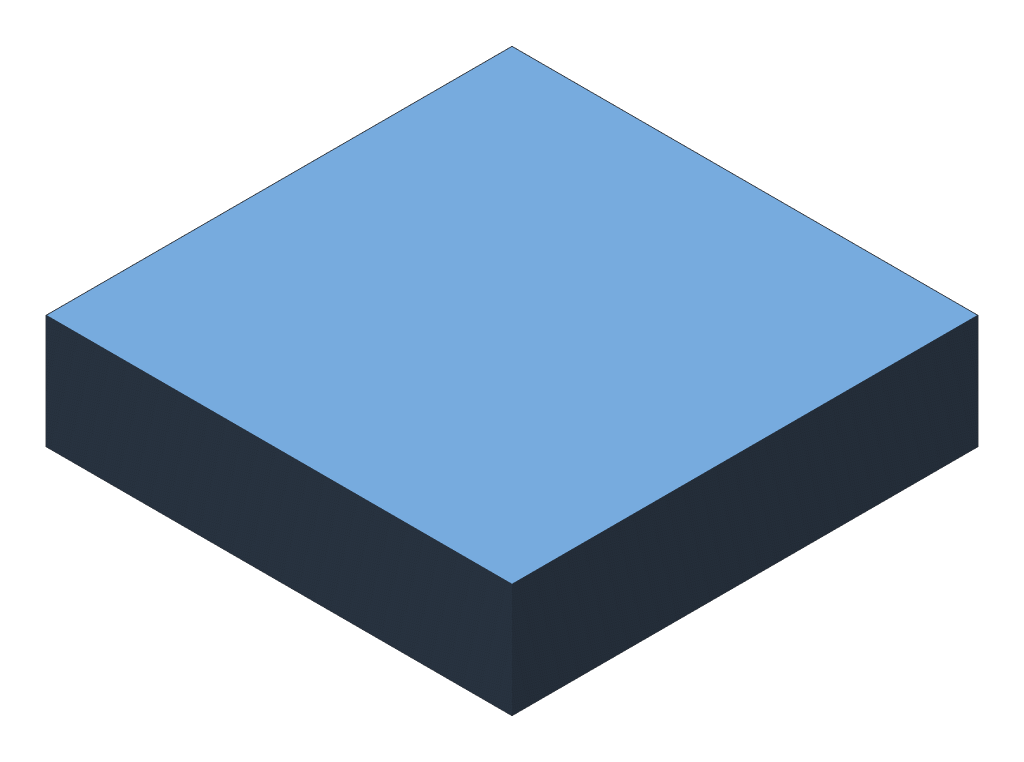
SolidWorks assembly Papierstapel.SLDASM, configuration Standard (file format 4700). Lengths in mm.
Overall size (90 21.99 90).
200 component instances, 1 part files, 0 mates.
Components (placement in the parent):
- BlattPapier-1: BlattPapier.SLDPRT [Standard] at origin size (90 0.1 90)
- BlattPapier-2: BlattPapier.SLDPRT [Standard] at (0 0.11 0) size (90 0.1 90)
- BlattPapier-3: BlattPapier.SLDPRT [Standard] at (0 0.22 0) size (90 0.1 90)
- BlattPapier-4: BlattPapier.SLDPRT [Standard] at (0 0.33 0) size (90 0.1 90)
- BlattPapier-5: BlattPapier.SLDPRT [Standard] at (0 0.44 0) size (90 0.1 90)
- BlattPapier-6: BlattPapier.SLDPRT [Standard] at (0 0.55 0) size (90 0.1 90)
- BlattPapier-7: BlattPapier.SLDPRT [Standard] at (0 0.66 0) size (90 0.1 90)
- BlattPapier-8: BlattPapier.SLDPRT [Standard] at (0 0.77 0) size (90 0.1 90)
- BlattPapier-9: BlattPapier.SLDPRT [Standard] at (0 0.88 0) size (90 0.1 90)
- BlattPapier-10: BlattPapier.SLDPRT [Standard] at (0 0.99 0) size (90 0.1 90)
- BlattPapier-11: BlattPapier.SLDPRT [Standard] at (0 1.1 0) size (90 0.1 90)
- BlattPapier-12: BlattPapier.SLDPRT [Standard] at (0 1.21 0) size (90 0.1 90)
- BlattPapier-13: BlattPapier.SLDPRT [Standard] at (0 1.32 0) size (90 0.1 90)
- BlattPapier-14: BlattPapier.SLDPRT [Standard] at (0 1.43 0) size (90 0.1 90)
- BlattPapier-15: BlattPapier.SLDPRT [Standard] at (0 1.54 0) size (90 0.1 90)
- BlattPapier-16: BlattPapier.SLDPRT [Standard] at (0 1.65 0) size (90 0.1 90)
- BlattPapier-17: BlattPapier.SLDPRT [Standard] at (0 1.76 0) size (90 0.1 90)
- BlattPapier-18: BlattPapier.SLDPRT [Standard] at (0 1.87 0) size (90 0.1 90)
- BlattPapier-19: BlattPapier.SLDPRT [Standard] at (0 1.98 0) size (90 0.1 90)
- BlattPapier-20: BlattPapier.SLDPRT [Standard] at (0 2.09 0) size (90 0.1 90)
- BlattPapier-21: BlattPapier.SLDPRT [Standard] at (0 2.2 0) size (90 0.1 90)
- BlattPapier-22: BlattPapier.SLDPRT [Standard] at (0 2.31 0) size (90 0.1 90)
- BlattPapier-23: BlattPapier.SLDPRT [Standard] at (0 2.42 0) size (90 0.1 90)
- BlattPapier-24: BlattPapier.SLDPRT [Standard] at (0 2.53 0) size (90 0.1 90)
- BlattPapier-25: BlattPapier.SLDPRT [Standard] at (0 2.64 0) size (90 0.1 90)
- BlattPapier-26: BlattPapier.SLDPRT [Standard] at (0 2.75 0) size (90 0.1 90)
- BlattPapier-27: BlattPapier.SLDPRT [Standard] at (0 2.86 0) size (90 0.1 90)
- BlattPapier-28: BlattPapier.SLDPRT [Standard] at (0 2.97 0) size (90 0.1 90)
- BlattPapier-29: BlattPapier.SLDPRT [Standard] at (0 3.08 0) size (90 0.1 90)
- BlattPapier-30: BlattPapier.SLDPRT [Standard] at (0 3.19 0) size (90 0.1 90)
- BlattPapier-31: BlattPapier.SLDPRT [Standard] at (0 3.3 0) size (90 0.1 90)
- BlattPapier-32: BlattPapier.SLDPRT [Standard] at (0 3.41 0) size (90 0.1 90)
- BlattPapier-33: BlattPapier.SLDPRT [Standard] at (0 3.52 0) size (90 0.1 90)
- BlattPapier-34: BlattPapier.SLDPRT [Standard] at (0 3.63 0) size (90 0.1 90)
- BlattPapier-35: BlattPapier.SLDPRT [Standard] at (0 3.74 0) size (90 0.1 90)
- BlattPapier-36: BlattPapier.SLDPRT [Standard] at (0 3.85 0) size (90 0.1 90)
- BlattPapier-37: BlattPapier.SLDPRT [Standard] at (0 3.96 0) size (90 0.1 90)
- BlattPapier-38: BlattPapier.SLDPRT [Standard] at (0 4.07 0) size (90 0.1 90)
- BlattPapier-39: BlattPapier.SLDPRT [Standard] at (0 4.18 0) size (90 0.1 90)
- BlattPapier-40: BlattPapier.SLDPRT [Standard] at (0 4.29 0) size (90 0.1 90)
- BlattPapier-41: BlattPapier.SLDPRT [Standard] at (0 4.4 0) size (90 0.1 90)
- BlattPapier-42: BlattPapier.SLDPRT [Standard] at (0 4.51 0) size (90 0.1 90)
- BlattPapier-43: BlattPapier.SLDPRT [Standard] at (0 4.62 0) size (90 0.1 90)
- BlattPapier-44: BlattPapier.SLDPRT [Standard] at (0 4.73 0) size (90 0.1 90)
- BlattPapier-45: BlattPapier.SLDPRT [Standard] at (0 4.84 0) size (90 0.1 90)
- BlattPapier-46: BlattPapier.SLDPRT [Standard] at (0 4.95 0) size (90 0.1 90)
- BlattPapier-47: BlattPapier.SLDPRT [Standard] at (0 5.06 0) size (90 0.1 90)
- BlattPapier-48: BlattPapier.SLDPRT [Standard] at (0 5.17 0) size (90 0.1 90)
- BlattPapier-49: BlattPapier.SLDPRT [Standard] at (0 5.28 0) size (90 0.1 90)
- BlattPapier-50: BlattPapier.SLDPRT [Standard] at (0 5.39 0) size (90 0.1 90)
- BlattPapier-51: BlattPapier.SLDPRT [Standard] at (0 5.5 0) size (90 0.1 90)
- BlattPapier-52: BlattPapier.SLDPRT [Standard] at (0 5.61 0) size (90 0.1 90)
- BlattPapier-53: BlattPapier.SLDPRT [Standard] at (0 5.72 0) size (90 0.1 90)
- BlattPapier-54: BlattPapier.SLDPRT [Standard] at (0 5.83 0) size (90 0.1 90)
- BlattPapier-55: BlattPapier.SLDPRT [Standard] at (0 5.94 0) size (90 0.1 90)
- BlattPapier-56: BlattPapier.SLDPRT [Standard] at (0 6.05 0) size (90 0.1 90)
- BlattPapier-57: BlattPapier.SLDPRT [Standard] at (0 6.16 0) size (90 0.1 90)
- BlattPapier-58: BlattPapier.SLDPRT [Standard] at (0 6.27 0) size (90 0.1 90)
- BlattPapier-59: BlattPapier.SLDPRT [Standard] at (0 6.38 0) size (90 0.1 90)
- BlattPapier-60: BlattPapier.SLDPRT [Standard] at (0 6.49 0) size (90 0.1 90)
- BlattPapier-61: BlattPapier.SLDPRT [Standard] at (0 6.6 0) size (90 0.1 90)
- BlattPapier-62: BlattPapier.SLDPRT [Standard] at (0 6.71 0) size (90 0.1 90)
- BlattPapier-63: BlattPapier.SLDPRT [Standard] at (0 6.82 0) size (90 0.1 90)
- BlattPapier-64: BlattPapier.SLDPRT [Standard] at (0 6.93 0) size (90 0.1 90)
- BlattPapier-65: BlattPapier.SLDPRT [Standard] at (0 7.04 0) size (90 0.1 90)
- BlattPapier-66: BlattPapier.SLDPRT [Standard] at (0 7.15 0) size (90 0.1 90)
- BlattPapier-67: BlattPapier.SLDPRT [Standard] at (0 7.26 0) size (90 0.1 90)
- BlattPapier-68: BlattPapier.SLDPRT [Standard] at (0 7.37 0) size (90 0.1 90)
- BlattPapier-69: BlattPapier.SLDPRT [Standard] at (0 7.48 0) size (90 0.1 90)
- BlattPapier-70: BlattPapier.SLDPRT [Standard] at (0 7.59 0) size (90 0.1 90)
- BlattPapier-71: BlattPapier.SLDPRT [Standard] at (0 7.7 0) size (90 0.1 90)
- BlattPapier-72: BlattPapier.SLDPRT [Standard] at (0 7.81 0) size (90 0.1 90)
- BlattPapier-73: BlattPapier.SLDPRT [Standard] at (0 7.92 0) size (90 0.1 90)
- BlattPapier-74: BlattPapier.SLDPRT [Standard] at (0 8.03 0) size (90 0.1 90)
- BlattPapier-75: BlattPapier.SLDPRT [Standard] at (0 8.14 0) size (90 0.1 90)
- BlattPapier-76: BlattPapier.SLDPRT [Standard] at (0 8.25 0) size (90 0.1 90)
- BlattPapier-77: BlattPapier.SLDPRT [Standard] at (0 8.36 0) size (90 0.1 90)
- BlattPapier-78: BlattPapier.SLDPRT [Standard] at (0 8.47 0) size (90 0.1 90)
- BlattPapier-79: BlattPapier.SLDPRT [Standard] at (0 8.58 0) size (90 0.1 90)
- BlattPapier-80: BlattPapier.SLDPRT [Standard] at (0 8.69 0) size (90 0.1 90)
- BlattPapier-81: BlattPapier.SLDPRT [Standard] at (0 8.8 0) size (90 0.1 90)
- BlattPapier-82: BlattPapier.SLDPRT [Standard] at (0 8.91 0) size (90 0.1 90)
- BlattPapier-83: BlattPapier.SLDPRT [Standard] at (0 9.02 0) size (90 0.1 90)
- BlattPapier-84: BlattPapier.SLDPRT [Standard] at (0 9.13 0) size (90 0.1 90)
- BlattPapier-85: BlattPapier.SLDPRT [Standard] at (0 9.24 0) size (90 0.1 90)
- BlattPapier-86: BlattPapier.SLDPRT [Standard] at (0 9.35 0) size (90 0.1 90)
- BlattPapier-87: BlattPapier.SLDPRT [Standard] at (0 9.46 0) size (90 0.1 90)
- BlattPapier-88: BlattPapier.SLDPRT [Standard] at (0 9.57 0) size (90 0.1 90)
- BlattPapier-89: BlattPapier.SLDPRT [Standard] at (0 9.68 0) size (90 0.1 90)
- BlattPapier-90: BlattPapier.SLDPRT [Standard] at (0 9.79 0) size (90 0.1 90)
- BlattPapier-91: BlattPapier.SLDPRT [Standard] at (0 9.9 0) size (90 0.1 90)
- BlattPapier-92: BlattPapier.SLDPRT [Standard] at (0 10.01 0) size (90 0.1 90)
- BlattPapier-93: BlattPapier.SLDPRT [Standard] at (0 10.12 0) size (90 0.1 90)
- BlattPapier-94: BlattPapier.SLDPRT [Standard] at (0 10.23 0) size (90 0.1 90)
- BlattPapier-95: BlattPapier.SLDPRT [Standard] at (0 10.34 0) size (90 0.1 90)
- BlattPapier-96: BlattPapier.SLDPRT [Standard] at (0 10.45 0) size (90 0.1 90)
- BlattPapier-97: BlattPapier.SLDPRT [Standard] at (0 10.56 0) size (90 0.1 90)
- BlattPapier-98: BlattPapier.SLDPRT [Standard] at (0 10.67 0) size (90 0.1 90)
- BlattPapier-99: BlattPapier.SLDPRT [Standard] at (0 10.78 0) size (90 0.1 90)
- BlattPapier-100: BlattPapier.SLDPRT [Standard] at (0 10.89 0) size (90 0.1 90)
- BlattPapier-101: BlattPapier.SLDPRT [Standard] at (0 11 0) size (90 0.1 90)
- BlattPapier-102: BlattPapier.SLDPRT [Standard] at (0 11.11 0) size (90 0.1 90)
- BlattPapier-103: BlattPapier.SLDPRT [Standard] at (0 11.22 0) size (90 0.1 90)
- BlattPapier-104: BlattPapier.SLDPRT [Standard] at (0 11.33 0) size (90 0.1 90)
- BlattPapier-105: BlattPapier.SLDPRT [Standard] at (0 11.44 0) size (90 0.1 90)
- BlattPapier-106: BlattPapier.SLDPRT [Standard] at (0 11.55 0) size (90 0.1 90)
- BlattPapier-107: BlattPapier.SLDPRT [Standard] at (0 11.66 0) size (90 0.1 90)
- BlattPapier-108: BlattPapier.SLDPRT [Standard] at (0 11.77 0) size (90 0.1 90)
- BlattPapier-109: BlattPapier.SLDPRT [Standard] at (0 11.88 0) size (90 0.1 90)
- BlattPapier-110: BlattPapier.SLDPRT [Standard] at (0 11.99 0) size (90 0.1 90)
- BlattPapier-111: BlattPapier.SLDPRT [Standard] at (0 12.1 0) size (90 0.1 90)
- BlattPapier-112: BlattPapier.SLDPRT [Standard] at (0 12.21 0) size (90 0.1 90)
- BlattPapier-113: BlattPapier.SLDPRT [Standard] at (0 12.32 0) size (90 0.1 90)
- BlattPapier-114: BlattPapier.SLDPRT [Standard] at (0 12.43 0) size (90 0.1 90)
- BlattPapier-115: BlattPapier.SLDPRT [Standard] at (0 12.54 0) size (90 0.1 90)
- BlattPapier-116: BlattPapier.SLDPRT [Standard] at (0 12.65 0) size (90 0.1 90)
- BlattPapier-117: BlattPapier.SLDPRT [Standard] at (0 12.76 0) size (90 0.1 90)
- BlattPapier-118: BlattPapier.SLDPRT [Standard] at (0 12.87 0) size (90 0.1 90)
- BlattPapier-119: BlattPapier.SLDPRT [Standard] at (0 12.98 0) size (90 0.1 90)
- BlattPapier-120: BlattPapier.SLDPRT [Standard] at (0 13.09 0) size (90 0.1 90)
- BlattPapier-121: BlattPapier.SLDPRT [Standard] at (0 13.2 0) size (90 0.1 90)
- BlattPapier-122: BlattPapier.SLDPRT [Standard] at (0 13.31 0) size (90 0.1 90)
- BlattPapier-123: BlattPapier.SLDPRT [Standard] at (0 13.42 0) size (90 0.1 90)
- BlattPapier-124: BlattPapier.SLDPRT [Standard] at (0 13.53 0) size (90 0.1 90)
- BlattPapier-125: BlattPapier.SLDPRT [Standard] at (0 13.64 0) size (90 0.1 90)
- BlattPapier-126: BlattPapier.SLDPRT [Standard] at (0 13.75 0) size (90 0.1 90)
- BlattPapier-127: BlattPapier.SLDPRT [Standard] at (0 13.86 0) size (90 0.1 90)
- BlattPapier-128: BlattPapier.SLDPRT [Standard] at (0 13.97 0) size (90 0.1 90)
- BlattPapier-129: BlattPapier.SLDPRT [Standard] at (0 14.08 0) size (90 0.1 90)
- BlattPapier-130: BlattPapier.SLDPRT [Standard] at (0 14.19 0) size (90 0.1 90)
- BlattPapier-131: BlattPapier.SLDPRT [Standard] at (0 14.3 0) size (90 0.1 90)
- BlattPapier-132: BlattPapier.SLDPRT [Standard] at (0 14.41 0) size (90 0.1 90)
- BlattPapier-133: BlattPapier.SLDPRT [Standard] at (0 14.52 0) size (90 0.1 90)
- BlattPapier-134: BlattPapier.SLDPRT [Standard] at (0 14.63 0) size (90 0.1 90)
- BlattPapier-135: BlattPapier.SLDPRT [Standard] at (0 14.74 0) size (90 0.1 90)
- BlattPapier-136: BlattPapier.SLDPRT [Standard] at (0 14.85 0) size (90 0.1 90)
- BlattPapier-137: BlattPapier.SLDPRT [Standard] at (0 14.96 0) size (90 0.1 90)
- BlattPapier-138: BlattPapier.SLDPRT [Standard] at (0 15.07 0) size (90 0.1 90)
- BlattPapier-139: BlattPapier.SLDPRT [Standard] at (0 15.18 0) size (90 0.1 90)
- BlattPapier-140: BlattPapier.SLDPRT [Standard] at (0 15.29 0) size (90 0.1 90)
- BlattPapier-141: BlattPapier.SLDPRT [Standard] at (0 15.4 0) size (90 0.1 90)
- BlattPapier-142: BlattPapier.SLDPRT [Standard] at (0 15.51 0) size (90 0.1 90)
- BlattPapier-143: BlattPapier.SLDPRT [Standard] at (0 15.62 0) size (90 0.1 90)
- BlattPapier-144: BlattPapier.SLDPRT [Standard] at (0 15.73 0) size (90 0.1 90)
- BlattPapier-145: BlattPapier.SLDPRT [Standard] at (0 15.84 0) size (90 0.1 90)
- BlattPapier-146: BlattPapier.SLDPRT [Standard] at (0 15.95 0) size (90 0.1 90)
- BlattPapier-147: BlattPapier.SLDPRT [Standard] at (0 16.06 0) size (90 0.1 90)
- BlattPapier-148: BlattPapier.SLDPRT [Standard] at (0 16.17 0) size (90 0.1 90)
- BlattPapier-149: BlattPapier.SLDPRT [Standard] at (0 16.28 0) size (90 0.1 90)
- BlattPapier-150: BlattPapier.SLDPRT [Standard] at (0 16.39 0) size (90 0.1 90)
- BlattPapier-151: BlattPapier.SLDPRT [Standard] at (0 16.5 0) size (90 0.1 90)
- BlattPapier-152: BlattPapier.SLDPRT [Standard] at (0 16.61 0) size (90 0.1 90)
- BlattPapier-153: BlattPapier.SLDPRT [Standard] at (0 16.72 0) size (90 0.1 90)
- BlattPapier-154: BlattPapier.SLDPRT [Standard] at (0 16.83 0) size (90 0.1 90)
- BlattPapier-155: BlattPapier.SLDPRT [Standard] at (0 16.94 0) size (90 0.1 90)
- BlattPapier-156: BlattPapier.SLDPRT [Standard] at (0 17.05 0) size (90 0.1 90)
- BlattPapier-157: BlattPapier.SLDPRT [Standard] at (0 17.16 0) size (90 0.1 90)
- BlattPapier-158: BlattPapier.SLDPRT [Standard] at (0 17.27 0) size (90 0.1 90)
- BlattPapier-159: BlattPapier.SLDPRT [Standard] at (0 17.38 0) size (90 0.1 90)
- BlattPapier-160: BlattPapier.SLDPRT [Standard] at (0 17.49 0) size (90 0.1 90)
- BlattPapier-161: BlattPapier.SLDPRT [Standard] at (0 17.6 0) size (90 0.1 90)
- BlattPapier-162: BlattPapier.SLDPRT [Standard] at (0 17.71 0) size (90 0.1 90)
- BlattPapier-163: BlattPapier.SLDPRT [Standard] at (0 17.82 0) size (90 0.1 90)
- BlattPapier-164: BlattPapier.SLDPRT [Standard] at (0 17.93 0) size (90 0.1 90)
- BlattPapier-165: BlattPapier.SLDPRT [Standard] at (0 18.04 0) size (90 0.1 90)
- BlattPapier-166: BlattPapier.SLDPRT [Standard] at (0 18.15 0) size (90 0.1 90)
- BlattPapier-167: BlattPapier.SLDPRT [Standard] at (0 18.26 0) size (90 0.1 90)
- BlattPapier-168: BlattPapier.SLDPRT [Standard] at (0 18.37 0) size (90 0.1 90)
- BlattPapier-169: BlattPapier.SLDPRT [Standard] at (0 18.48 0) size (90 0.1 90)
- BlattPapier-170: BlattPapier.SLDPRT [Standard] at (0 18.59 0) size (90 0.1 90)
- BlattPapier-171: BlattPapier.SLDPRT [Standard] at (0 18.7 0) size (90 0.1 90)
- BlattPapier-172: BlattPapier.SLDPRT [Standard] at (0 18.81 0) size (90 0.1 90)
- BlattPapier-173: BlattPapier.SLDPRT [Standard] at (0 18.92 0) size (90 0.1 90)
- BlattPapier-174: BlattPapier.SLDPRT [Standard] at (0 19.03 0) size (90 0.1 90)
- BlattPapier-175: BlattPapier.SLDPRT [Standard] at (0 19.14 0) size (90 0.1 90)
- BlattPapier-176: BlattPapier.SLDPRT [Standard] at (0 19.25 0) size (90 0.1 90)
- BlattPapier-177: BlattPapier.SLDPRT [Standard] at (0 19.36 0) size (90 0.1 90)
- BlattPapier-178: BlattPapier.SLDPRT [Standard] at (0 19.47 0) size (90 0.1 90)
- BlattPapier-179: BlattPapier.SLDPRT [Standard] at (0 19.58 0) size (90 0.1 90)
- BlattPapier-180: BlattPapier.SLDPRT [Standard] at (0 19.69 0) size (90 0.1 90)
- BlattPapier-181: BlattPapier.SLDPRT [Standard] at (0 19.8 0) size (90 0.1 90)
- BlattPapier-182: BlattPapier.SLDPRT [Standard] at (0 19.91 0) size (90 0.1 90)
- BlattPapier-183: BlattPapier.SLDPRT [Standard] at (0 20.02 0) size (90 0.1 90)
- BlattPapier-184: BlattPapier.SLDPRT [Standard] at (0 20.13 0) size (90 0.1 90)
- BlattPapier-185: BlattPapier.SLDPRT [Standard] at (0 20.24 0) size (90 0.1 90)
- BlattPapier-186: BlattPapier.SLDPRT [Standard] at (0 20.35 0) size (90 0.1 90)
- BlattPapier-187: BlattPapier.SLDPRT [Standard] at (0 20.46 0) size (90 0.1 90)
- BlattPapier-188: BlattPapier.SLDPRT [Standard] at (0 20.57 0) size (90 0.1 90)
- BlattPapier-189: BlattPapier.SLDPRT [Standard] at (0 20.68 0) size (90 0.1 90)
- BlattPapier-190: BlattPapier.SLDPRT [Standard] at (0 20.79 0) size (90 0.1 90)
- BlattPapier-191: BlattPapier.SLDPRT [Standard] at (0 20.9 0) size (90 0.1 90)
- BlattPapier-192: BlattPapier.SLDPRT [Standard] at (0 21.01 0) size (90 0.1 90)
- BlattPapier-193: BlattPapier.SLDPRT [Standard] at (0 21.12 0) size (90 0.1 90)
- BlattPapier-194: BlattPapier.SLDPRT [Standard] at (0 21.23 0) size (90 0.1 90)
- BlattPapier-195: BlattPapier.SLDPRT [Standard] at (0 21.34 0) size (90 0.1 90)
- BlattPapier-196: BlattPapier.SLDPRT [Standard] at (0 21.45 0) size (90 0.1 90)
- BlattPapier-197: BlattPapier.SLDPRT [Standard] at (0 21.56 0) size (90 0.1 90)
- BlattPapier-198: BlattPapier.SLDPRT [Standard] at (0 21.67 0) size (90 0.1 90)
- BlattPapier-199: BlattPapier.SLDPRT [Standard] at (0 21.78 0) size (90 0.1 90)
- BlattPapier-200: BlattPapier.SLDPRT [Standard] at (0 21.89 0) size (90 0.1 90)
